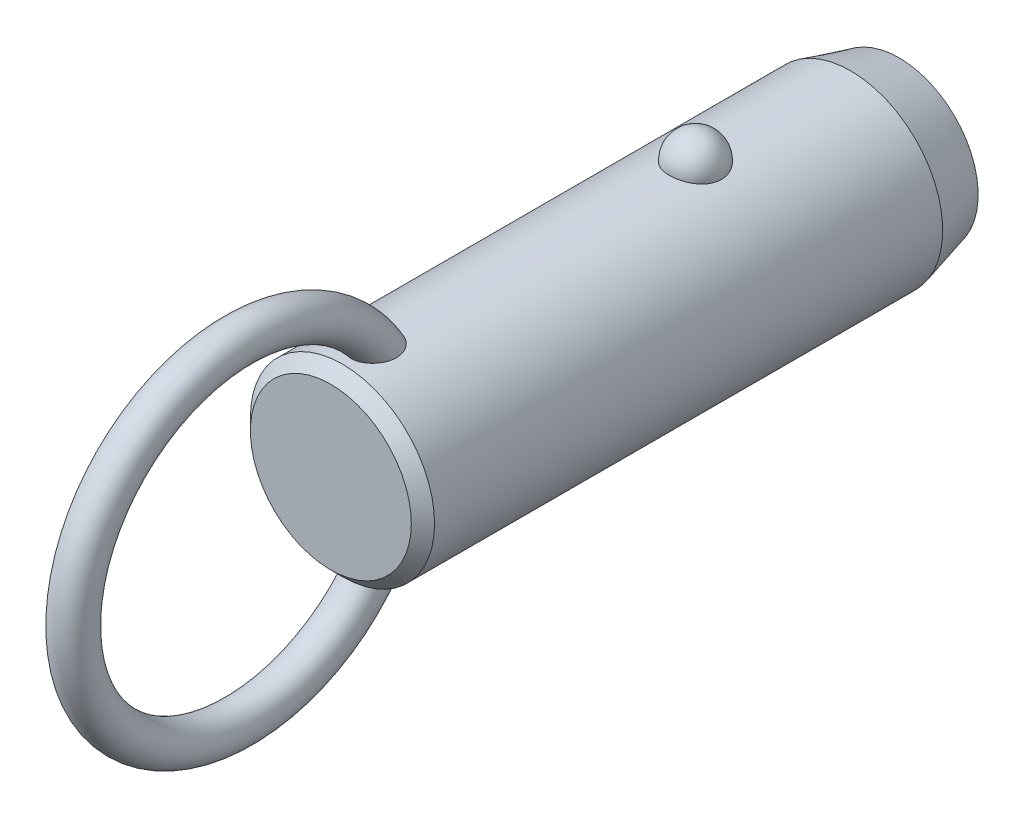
ISO-10303-21;
HEADER;
FILE_DESCRIPTION(('STEP AP214'),'2;1');
FILE_NAME('part.step','',(''),(''),'','','');
FILE_SCHEMA(('AUTOMOTIVE_DESIGN { 1 0 10303 214 1 1 1 1 }'));
ENDSEC;
DATA;
#1=APPLICATION_CONTEXT('core data for automotive mechanical design processes');
#2=APPLICATION_PROTOCOL_DEFINITION('international standard','automotive_design',2000,#1);
#3=PRODUCT_CONTEXT('',#1,'mechanical');
#4=PRODUCT('Part','Part','',(#3));
#5=PRODUCT_RELATED_PRODUCT_CATEGORY('part','',(#4));
#6=PRODUCT_DEFINITION_FORMATION('','',#4);
#7=PRODUCT_DEFINITION_CONTEXT('part definition',#1,'design');
#8=PRODUCT_DEFINITION('design','',#6,#7);
#9=PRODUCT_DEFINITION_SHAPE('','',#8);
#10=(LENGTH_UNIT() NAMED_UNIT(*) SI_UNIT(.MILLI.,.METRE.));
#11=(NAMED_UNIT(*) PLANE_ANGLE_UNIT() SI_UNIT($,.RADIAN.));
#12=(NAMED_UNIT(*) SI_UNIT($,.STERADIAN.) SOLID_ANGLE_UNIT());
#13=UNCERTAINTY_MEASURE_WITH_UNIT(LENGTH_MEASURE(1.E-05),#10,'distance_accuracy_value','');
#14=(GEOMETRIC_REPRESENTATION_CONTEXT(3) GLOBAL_UNCERTAINTY_ASSIGNED_CONTEXT((#13)) GLOBAL_UNIT_ASSIGNED_CONTEXT((#10,
#11,#12)) REPRESENTATION_CONTEXT('',''));
#15=CARTESIAN_POINT('',(0.,0.,0.));
#16=DIRECTION('',(0.,0.,1.));
#17=DIRECTION('',(1.,0.,0.));
#18=AXIS2_PLACEMENT_3D('',#15,#16,#17);
#19=CARTESIAN_POINT('',(0.,0.,25.4));
#20=DIRECTION('',(0.,0.,-1.));
#21=DIRECTION('',(-1.,0.,0.));
#22=AXIS2_PLACEMENT_3D('',#19,#20,#21);
#23=CYLINDRICAL_SURFACE('',#22,9.5);
#24=CARTESIAN_POINT('',(2.67259918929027,9.11631578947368,-2.70000000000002));
#25=CARTESIAN_POINT('',(2.6725968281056,9.11631786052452,-2.54909854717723));
#26=CARTESIAN_POINT('',(2.66030567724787,9.11994722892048,-2.39816735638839));
#27=CARTESIAN_POINT('',(2.6114347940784,9.13405924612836,-2.10058568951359));
#28=CARTESIAN_POINT('',(2.57484658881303,9.14454428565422,-1.95393672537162));
#29=CARTESIAN_POINT('',(2.47830875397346,9.17117631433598,-1.66916069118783));
#30=CARTESIAN_POINT('',(2.41836936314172,9.18732082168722,-1.53102991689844));
#31=CARTESIAN_POINT('',(2.27661331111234,9.22346780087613,-1.26705393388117));
#32=CARTESIAN_POINT('',(2.19479699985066,9.24347021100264,-1.14120852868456));
#33=CARTESIAN_POINT('',(2.01085282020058,9.28522401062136,-0.904632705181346));
#34=CARTESIAN_POINT('',(1.90862396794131,9.30698376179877,-0.793982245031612));
#35=CARTESIAN_POINT('',(1.6867437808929,9.34973971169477,-0.591607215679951));
#36=CARTESIAN_POINT('',(1.56709244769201,9.37073591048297,-0.499882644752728));
#37=CARTESIAN_POINT('',(1.31393976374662,9.40956370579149,-0.338167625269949));
#38=CARTESIAN_POINT('',(1.18048026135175,9.42740444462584,-0.268113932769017));
#39=CARTESIAN_POINT('',(0.903154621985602,9.45799906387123,-0.151390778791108));
#40=CARTESIAN_POINT('',(0.759289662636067,9.47075351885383,-0.104718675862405));
#41=CARTESIAN_POINT('',(0.468074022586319,9.48956256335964,-0.0367633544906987));
#42=CARTESIAN_POINT('',(0.320836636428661,9.49573643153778,-0.015027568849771));
#43=CARTESIAN_POINT('',(0.0246714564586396,9.50112183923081,0.00396199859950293));
#44=CARTESIAN_POINT('',(-0.124256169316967,9.50033406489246,0.00121819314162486));
#45=CARTESIAN_POINT('',(-0.417264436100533,9.4919475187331,-0.0284441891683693));
#46=CARTESIAN_POINT('',(-0.561384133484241,9.48444885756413,-0.0550074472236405));
#47=CARTESIAN_POINT('',(-0.842986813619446,9.46357853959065,-0.131064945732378));
#48=CARTESIAN_POINT('',(-0.98046968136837,9.450206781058,-0.180559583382));
#49=CARTESIAN_POINT('',(-1.24585005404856,9.41890822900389,-0.301476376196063));
#50=CARTESIAN_POINT('',(-1.37368611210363,9.40095498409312,-0.373026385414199));
#51=CARTESIAN_POINT('',(-1.61552738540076,9.3624296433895,-0.536025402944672));
#52=CARTESIAN_POINT('',(-1.72953116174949,9.34185727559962,-0.627476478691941));
#53=CARTESIAN_POINT('',(-1.9429225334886,9.29984568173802,-0.829844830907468));
#54=CARTESIAN_POINT('',(-2.04198021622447,9.27839736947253,-0.941108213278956));
#55=CARTESIAN_POINT('',(-2.2202646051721,9.23735994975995,-1.17883414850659));
#56=CARTESIAN_POINT('',(-2.29948985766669,9.21777097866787,-1.30529781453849));
#57=CARTESIAN_POINT('',(-2.43697287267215,9.18238994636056,-1.57158566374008));
#58=CARTESIAN_POINT('',(-2.49497068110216,9.16664569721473,-1.71155057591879));
#59=CARTESIAN_POINT('',(-2.5872073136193,9.14104303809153,-1.99961197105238));
#60=CARTESIAN_POINT('',(-2.62144683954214,9.13118445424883,-2.1477082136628));
#61=CARTESIAN_POINT('',(-2.66521466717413,9.11850622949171,-2.44715424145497));
#62=CARTESIAN_POINT('',(-2.67484831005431,9.11565658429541,-2.59848735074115));
#63=CARTESIAN_POINT('',(-2.66946735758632,9.11723375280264,-2.90067317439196));
#64=CARTESIAN_POINT('',(-2.65445345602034,9.12166036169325,-3.05152590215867));
#65=CARTESIAN_POINT('',(-2.6002971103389,9.13724422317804,-3.34766110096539));
#66=CARTESIAN_POINT('',(-2.56127978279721,9.14836656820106,-3.49296833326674));
#67=CARTESIAN_POINT('',(-2.46018844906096,9.17606676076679,-3.77477535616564));
#68=CARTESIAN_POINT('',(-2.39811349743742,9.19264483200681,-3.91127478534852));
#69=CARTESIAN_POINT('',(-2.25202303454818,9.22952198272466,-4.17244273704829));
#70=CARTESIAN_POINT('',(-2.16788714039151,9.24984129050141,-4.29704106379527));
#71=CARTESIAN_POINT('',(-1.9799408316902,9.29188255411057,-4.53013066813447));
#72=CARTESIAN_POINT('',(-1.87612963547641,9.31360456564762,-4.63862130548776));
#73=CARTESIAN_POINT('',(-1.65105429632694,9.35612959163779,-4.83690299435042));
#74=CARTESIAN_POINT('',(-1.52972405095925,9.37692871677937,-4.9266199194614));
#75=CARTESIAN_POINT('',(-1.27318250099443,9.41518970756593,-5.08429106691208));
#76=CARTESIAN_POINT('',(-1.13797219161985,9.432651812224,-5.15224684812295));
#77=CARTESIAN_POINT('',(-0.859280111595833,9.46208255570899,-5.26371827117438));
#78=CARTESIAN_POINT('',(-0.715925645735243,9.47411833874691,-5.30753421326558));
#79=CARTESIAN_POINT('',(-0.423550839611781,9.4916822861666,-5.37076321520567));
#80=CARTESIAN_POINT('',(-0.274531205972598,9.49721125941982,-5.39017930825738));
#81=CARTESIAN_POINT('',(0.0218446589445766,9.50110860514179,-5.40390587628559));
#82=CARTESIAN_POINT('',(0.169177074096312,9.49961381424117,-5.39869609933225));
#83=CARTESIAN_POINT('',(0.460808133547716,9.48993906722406,-5.36441955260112));
#84=CARTESIAN_POINT('',(0.605106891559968,9.48175936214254,-5.33535367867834));
#85=CARTESIAN_POINT('',(0.886027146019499,9.4596376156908,-5.25435587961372));
#86=CARTESIAN_POINT('',(1.02267710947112,9.44571881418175,-5.20251612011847));
#87=CARTESIAN_POINT('',(1.28523827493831,9.41358993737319,-5.07741549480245));
#88=CARTESIAN_POINT('',(1.41114877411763,9.39537958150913,-5.00415322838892));
#89=CARTESIAN_POINT('',(1.65085227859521,9.3562644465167,-4.83684599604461));
#90=CARTESIAN_POINT('',(1.76442346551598,9.33532178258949,-4.74249218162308));
#91=CARTESIAN_POINT('',(1.97425672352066,9.29321198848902,-4.53620389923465));
#92=CARTESIAN_POINT('',(2.07051582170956,9.27204482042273,-4.42426641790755));
#93=CARTESIAN_POINT('',(2.24490086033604,9.23139221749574,-4.18363183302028));
#94=CARTESIAN_POINT('',(2.32267019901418,9.21194380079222,-4.05466990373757));
#95=CARTESIAN_POINT('',(2.45584092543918,9.1773419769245,-3.78517836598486));
#96=CARTESIAN_POINT('',(2.51124979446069,9.16218713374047,-3.644652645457));
#97=CARTESIAN_POINT('',(2.59380876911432,9.13913522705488,-3.37104301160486));
#98=CARTESIAN_POINT('',(2.62330266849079,9.13064624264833,-3.23871053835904));
#99=CARTESIAN_POINT('',(2.66269870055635,9.11923566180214,-2.97092664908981));
#100=CARTESIAN_POINT('',(2.67260130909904,9.11631393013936,-2.83547530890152));
#101=CARTESIAN_POINT('',(2.67259918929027,9.11631578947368,-2.70000000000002));
#102=B_SPLINE_CURVE_WITH_KNOTS('',3,(#24,#25,#26,#27,#28,#29,#30,#31,#32,#33,#34,#35,#36,#37,
#38,#39,#40,#41,#42,#43,#44,#45,#46,#47,#48,#49,#50,#51,#52,#53,#54,#55,#56,#57,#58,#59,#60,#61,
#62,#63,#64,#65,#66,#67,#68,#69,#70,#71,#72,#73,#74,#75,#76,#77,#78,#79,#80,#81,#82,#83,#84,#85,
#86,#87,#88,#89,#90,#91,#92,#93,#94,#95,#96,#97,#98,#99,#100,#101),.UNSPECIFIED.,.T.,.F.,(4,2,2,
2,2,2,2,2,2,2,2,2,2,2,2,2,2,2,2,2,2,2,2,2,2,2,2,2,2,2,2,2,2,2,2,2,2,2,4),(0.,0.452217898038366,
0.904593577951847,1.35677112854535,1.80894144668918,2.26340676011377,2.71787203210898,
3.17099820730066,3.62407318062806,4.0687883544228,4.51345969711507,4.95160616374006,
5.38976021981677,5.83050358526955,6.27129275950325,6.72071308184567,7.17016633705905,
7.62495278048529,8.07972578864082,8.53254856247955,8.98535859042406,9.43582813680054,
9.88631615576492,10.3393155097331,10.7923328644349,11.2471065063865,11.7018475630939,
12.1507959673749,12.5996885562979,13.0398725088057,13.4800399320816,13.9184421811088,
14.3568730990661,14.802202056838,15.2476074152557,15.7010097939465,16.1542603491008,
16.5602594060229,16.9662486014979),.UNSPECIFIED.);
#103=CARTESIAN_POINT('',(2.67259918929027,9.11631578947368,-2.70000000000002));
#104=VERTEX_POINT('',#103);
#105=EDGE_CURVE('E41',#104,#104,#102,.T.);
#106=ORIENTED_EDGE('',*,*,#105,.T.);
#107=EDGE_LOOP('',(#106));
#108=FACE_BOUND('',#107,.T.);
#109=CARTESIAN_POINT('',(0.,0.,33.72));
#110=DIRECTION('',(0.,0.,1.));
#111=DIRECTION('',(1.,0.,0.));
#112=AXIS2_PLACEMENT_3D('',#109,#110,#111);
#113=CIRCLE('',#112,9.5);
#114=CARTESIAN_POINT('',(9.5,0.,33.72));
#115=VERTEX_POINT('',#114);
#116=EDGE_CURVE('E10',#115,#115,#113,.F.);
#117=ORIENTED_EDGE('',*,*,#116,.T.);
#118=EDGE_LOOP('',(#117));
#119=FACE_BOUND('',#118,.T.);
#120=CARTESIAN_POINT('',(-0.697062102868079,-9.47439269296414,28.0678088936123));
#121=CARTESIAN_POINT('',(-0.799579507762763,-9.46685146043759,28.1074823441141));
#122=CARTESIAN_POINT('',(-0.898575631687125,-9.45788043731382,28.1559309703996));
#123=CARTESIAN_POINT('',(-1.08670047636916,-9.43811593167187,28.2688685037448));
#124=CARTESIAN_POINT('',(-1.17583204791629,-9.42732297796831,28.3333527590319));
#125=CARTESIAN_POINT('',(-1.34179806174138,-9.40513672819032,28.4762099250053));
#126=CARTESIAN_POINT('',(-1.41865133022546,-9.39374438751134,28.554561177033));
#127=CARTESIAN_POINT('',(-1.5586004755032,-9.37154196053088,28.7227524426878));
#128=CARTESIAN_POINT('',(-1.62169476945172,-9.3607319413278,28.8125937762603));
#129=CARTESIAN_POINT('',(-1.73527695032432,-9.34035749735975,29.0045001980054));
#130=CARTESIAN_POINT('',(-1.7852226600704,-9.33085270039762,29.1068910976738));
#131=CARTESIAN_POINT('',(-1.86924997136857,-9.3143834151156,29.318148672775));
#132=CARTESIAN_POINT('',(-1.90332570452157,-9.30741986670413,29.4270177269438));
#133=CARTESIAN_POINT('',(-1.95893603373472,-9.29588482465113,29.6604730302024));
#134=CARTESIAN_POINT('',(-1.97872420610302,-9.29165182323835,29.7854890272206));
#135=CARTESIAN_POINT('',(-2.00062129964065,-9.28695978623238,30.0370805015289));
#136=CARTESIAN_POINT('',(-2.00272284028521,-9.28650232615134,30.163656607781));
#137=CARTESIAN_POINT('',(-1.98958876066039,-9.28932750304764,30.4368157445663));
#138=CARTESIAN_POINT('',(-1.97143366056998,-9.2932400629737,30.5832519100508));
#139=CARTESIAN_POINT('',(-1.91479925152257,-9.30507151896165,30.8720629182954));
#140=CARTESIAN_POINT('',(-1.87629122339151,-9.31299607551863,31.014431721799));
#141=CARTESIAN_POINT('',(-1.7722568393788,-9.33340232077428,31.3151725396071));
#142=CARTESIAN_POINT('',(-1.70334898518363,-9.34641636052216,31.4723691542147));
#143=CARTESIAN_POINT('',(-1.58111062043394,-9.36759153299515,31.6975171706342));
#144=CARTESIAN_POINT('',(-1.53721459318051,-9.37492619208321,31.7707968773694));
#145=CARTESIAN_POINT('',(-1.4430263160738,-9.38988566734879,31.9130740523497));
#146=CARTESIAN_POINT('',(-1.39273721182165,-9.39751033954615,31.9820736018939));
#147=CARTESIAN_POINT('',(-1.26775962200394,-9.41530678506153,32.1369832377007));
#148=CARTESIAN_POINT('',(-1.19052326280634,-9.42548108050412,32.2208712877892));
#149=CARTESIAN_POINT('',(-1.0242024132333,-9.44499825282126,32.3760086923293));
#150=CARTESIAN_POINT('',(-0.935139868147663,-9.45434261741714,32.4472808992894));
#151=CARTESIAN_POINT('',(-0.76661041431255,-9.46930670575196,32.5586955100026));
#152=CARTESIAN_POINT('',(-0.689439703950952,-9.47529223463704,32.6022354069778));
#153=CARTESIAN_POINT('',(-0.528942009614,-9.48560294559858,32.6763133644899));
#154=CARTESIAN_POINT('',(-0.445620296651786,-9.48992953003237,32.7068624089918));
#155=CARTESIAN_POINT('',(-0.273901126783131,-9.49644161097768,32.7525792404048));
#156=CARTESIAN_POINT('',(-0.185465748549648,-9.49860811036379,32.76761059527));
#157=CARTESIAN_POINT('',(-0.00734541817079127,-9.5004135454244,32.7801494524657));
#158=CARTESIAN_POINT('',(0.0823387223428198,-9.50005405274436,32.7776678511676));
#159=CARTESIAN_POINT('',(0.247679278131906,-9.49708301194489,32.7569959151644));
#160=CARTESIAN_POINT('',(0.323620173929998,-9.49477609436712,32.7409300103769));
#161=CARTESIAN_POINT('',(0.471981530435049,-9.48855917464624,32.6971726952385));
#162=CARTESIAN_POINT('',(0.544400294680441,-9.48464840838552,32.669475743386));
#163=CARTESIAN_POINT('',(0.708947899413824,-9.47398336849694,32.5928026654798));
#164=CARTESIAN_POINT('',(0.799149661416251,-9.46671310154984,32.5397745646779));
#165=CARTESIAN_POINT('',(0.969783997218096,-9.4507622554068,32.4199731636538));
#166=CARTESIAN_POINT('',(1.05019415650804,-9.44207854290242,32.3531692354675));
#167=CARTESIAN_POINT('',(1.23092343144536,-9.42051459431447,32.1807596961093));
#168=CARTESIAN_POINT('',(1.32652499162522,-9.40733378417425,32.0702619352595));
#169=CARTESIAN_POINT('',(1.49893121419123,-9.38140745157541,31.8355614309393));
#170=CARTESIAN_POINT('',(1.57571616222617,-9.36866239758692,31.7113445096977));
#171=CARTESIAN_POINT('',(1.71285426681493,-9.34457644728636,31.4493891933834));
#172=CARTESIAN_POINT('',(1.77266365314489,-9.33328726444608,31.3113623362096));
#173=CARTESIAN_POINT('',(1.87239208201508,-9.31379209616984,31.0280515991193));
#174=CARTESIAN_POINT('',(1.91230158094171,-9.3055875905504,30.882764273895));
#175=CARTESIAN_POINT('',(1.9760418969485,-9.29228394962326,30.5620281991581));
#176=CARTESIAN_POINT('',(1.99587438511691,-9.28797202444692,30.3857248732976));
#177=CARTESIAN_POINT('',(2.0029570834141,-9.28645519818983,30.0324146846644));
#178=CARTESIAN_POINT('',(1.99025930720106,-9.28923895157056,29.8554093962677));
#179=CARTESIAN_POINT('',(1.93735479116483,-9.30038134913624,29.5563381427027));
#180=CARTESIAN_POINT('',(1.90576827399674,-9.30697680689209,29.4326679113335));
#181=CARTESIAN_POINT('',(1.82287484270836,-9.32356855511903,29.1923297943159));
#182=CARTESIAN_POINT('',(1.7715821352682,-9.33356239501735,29.0756569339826));
#183=CARTESIAN_POINT('',(1.64885744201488,-9.35602275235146,28.8527061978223));
#184=CARTESIAN_POINT('',(1.57730995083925,-9.36850332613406,28.7464927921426));
#185=CARTESIAN_POINT('',(1.41543264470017,-9.39431873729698,28.5495530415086));
#186=CARTESIAN_POINT('',(1.3251088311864,-9.40765330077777,28.4588217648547));
#187=CARTESIAN_POINT('',(1.13846223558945,-9.43195720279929,28.3050334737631));
#188=CARTESIAN_POINT('',(1.04369890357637,-9.44302894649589,28.2400947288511));
#189=CARTESIAN_POINT('',(0.843965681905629,-9.46296805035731,28.1280388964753));
#190=CARTESIAN_POINT('',(0.739000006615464,-9.4718363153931,28.0809144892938));
#191=CARTESIAN_POINT('',(0.52817529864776,-9.48586140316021,28.0081173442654));
#192=CARTESIAN_POINT('',(0.422686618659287,-9.49119633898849,27.9814024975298));
#193=CARTESIAN_POINT('',(0.208590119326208,-9.49831365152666,27.9460137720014));
#194=CARTESIAN_POINT('',(0.0999817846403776,-9.500095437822,27.9373428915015));
#195=CARTESIAN_POINT('',(-0.126104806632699,-9.49988861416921,27.9383501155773));
#196=CARTESIAN_POINT('',(-0.243578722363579,-9.49757821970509,27.9495942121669));
#197=CARTESIAN_POINT('',(-0.474390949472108,-9.48885165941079,27.993167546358));
#198=CARTESIAN_POINT('',(-0.587729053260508,-9.48243528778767,28.0254978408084));
#199=CARTESIAN_POINT('',(-0.697062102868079,-9.47439269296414,28.0678088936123));
#200=B_SPLINE_CURVE_WITH_KNOTS('',3,(#120,#121,#122,#123,#124,#125,#126,#127,#128,#129,#130,
#131,#132,#133,#134,#135,#136,#137,#138,#139,#140,#141,#142,#143,#144,#145,#146,#147,#148,#149,
#150,#151,#152,#153,#154,#155,#156,#157,#158,#159,#160,#161,#162,#163,#164,#165,#166,#167,#168,
#169,#170,#171,#172,#173,#174,#175,#176,#177,#178,#179,#180,#181,#182,#183,#184,#185,#186,#187,
#188,#189,#190,#191,#192,#193,#194,#195,#196,#197,#198,#199),.UNSPECIFIED.,.T.,.F.,(4,2,2,2,2,2,
2,2,2,2,2,2,2,2,2,2,2,2,2,2,2,2,2,2,2,2,2,2,2,2,2,2,2,2,2,2,2,2,2,4),(0.,0.330119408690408,
0.660143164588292,0.989655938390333,1.31920659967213,1.66074728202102,2.00241415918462,
2.38088696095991,2.75951768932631,3.20065679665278,3.64242004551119,4.15620996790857,
4.41314162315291,4.66994734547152,5.01228664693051,5.35399933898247,5.61943037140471,
5.88463652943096,6.15215502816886,6.41950709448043,6.65144391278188,6.88349136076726,
7.19641200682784,7.51003602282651,7.94779711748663,8.38601491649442,8.83699707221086,
9.2881953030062,9.81778662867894,10.3465317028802,10.7284172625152,11.110028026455,
11.4938603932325,11.8775702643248,12.2220189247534,12.5663259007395,12.8915939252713,
13.2169159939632,13.5689650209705,13.9210316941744),.UNSPECIFIED.);
#201=CARTESIAN_POINT('',(-0.697062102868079,-9.47439269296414,28.0678088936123));
#202=VERTEX_POINT('',#201);
#203=EDGE_CURVE('E58',#202,#202,#200,.T.);
#204=ORIENTED_EDGE('',*,*,#203,.T.);
#205=EDGE_LOOP('',(#204));
#206=FACE_BOUND('',#205,.T.);
#207=CARTESIAN_POINT('',(-0.697062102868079,9.47439269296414,28.0678088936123));
#208=CARTESIAN_POINT('',(-0.597792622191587,9.48169483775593,28.0293956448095));
#209=CARTESIAN_POINT('',(-0.495106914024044,9.48766580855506,27.9991682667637));
#210=CARTESIAN_POINT('',(-0.285876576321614,9.49627648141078,27.9560327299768));
#211=CARTESIAN_POINT('',(-0.179324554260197,9.49890941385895,27.9431597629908));
#212=CARTESIAN_POINT('',(0.0344157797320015,9.50053798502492,27.9351666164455));
#213=CARTESIAN_POINT('',(0.141603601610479,9.49953613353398,27.9400341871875));
#214=CARTESIAN_POINT('',(0.353563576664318,9.49401038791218,27.9673654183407));
#215=CARTESIAN_POINT('',(0.458336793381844,9.48948807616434,27.98982117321));
#216=CARTESIAN_POINT('',(0.662493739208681,9.4774236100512,28.0516719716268));
#217=CARTESIAN_POINT('',(0.76188104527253,9.46988348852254,28.0910556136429));
#218=CARTESIAN_POINT('',(0.952608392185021,9.45260382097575,28.1856342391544));
#219=CARTESIAN_POINT('',(1.04394806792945,9.44286417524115,28.2408299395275));
#220=CARTESIAN_POINT('',(1.21712767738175,9.4221176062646,28.3660662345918));
#221=CARTESIAN_POINT('',(1.29885671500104,9.41109835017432,28.4362579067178));
#222=CARTESIAN_POINT('',(1.44978975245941,9.38903310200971,28.588980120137));
#223=CARTESIAN_POINT('',(1.51899278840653,9.37798710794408,28.6715116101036));
#224=CARTESIAN_POINT('',(1.64602857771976,9.35654375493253,28.8497763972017));
#225=CARTESIAN_POINT('',(1.70333052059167,9.34618688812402,28.9458916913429));
#226=CARTESIAN_POINT('',(1.80259341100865,9.32755128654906,29.145897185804));
#227=CARTESIAN_POINT('',(1.84454942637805,9.31927322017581,29.2497898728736));
#228=CARTESIAN_POINT('',(1.91637039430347,9.30478365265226,29.472213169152));
#229=CARTESIAN_POINT('',(1.944805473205,9.29882552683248,29.5912192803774));
#230=CARTESIAN_POINT('',(1.98449865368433,9.29043398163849,29.8321436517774));
#231=CARTESIAN_POINT('',(1.99574908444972,9.28800213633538,29.9540631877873));
#232=CARTESIAN_POINT('',(2.00275141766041,9.28649645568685,30.2169324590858));
#233=CARTESIAN_POINT('',(1.99588238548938,9.28799035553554,30.3579529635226));
#234=CARTESIAN_POINT('',(1.96270559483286,9.29505517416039,30.6376217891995));
#235=CARTESIAN_POINT('',(1.93637872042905,9.30063010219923,30.776267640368));
#236=CARTESIAN_POINT('',(1.85949176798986,9.31633564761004,31.0725616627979));
#237=CARTESIAN_POINT('',(1.80549792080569,9.3270926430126,31.2292907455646));
#238=CARTESIAN_POINT('',(1.67376869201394,9.3516306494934,31.5322840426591));
#239=CARTESIAN_POINT('',(1.59603181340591,9.36541185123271,31.6785475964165));
#240=CARTESIAN_POINT('',(1.4360277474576,9.39110706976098,31.9258138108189));
#241=CARTESIAN_POINT('',(1.35831795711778,9.40278656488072,32.029791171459));
#242=CARTESIAN_POINT('',(1.18774483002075,9.42585025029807,32.2245347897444));
#243=CARTESIAN_POINT('',(1.09490932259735,9.43723493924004,32.3153247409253));
#244=CARTESIAN_POINT('',(0.921110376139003,9.45552616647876,32.4562033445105));
#245=CARTESIAN_POINT('',(0.843738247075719,9.46281058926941,32.5106563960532));
#246=CARTESIAN_POINT('',(0.681245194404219,9.47589120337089,32.606711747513));
#247=CARTESIAN_POINT('',(0.596135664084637,9.48168953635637,32.6483325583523));
#248=CARTESIAN_POINT('',(0.433779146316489,9.49038144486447,32.7100899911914));
#249=CARTESIAN_POINT('',(0.357459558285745,9.49359170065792,32.7326013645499));
#250=CARTESIAN_POINT('',(0.202074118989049,9.49816761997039,32.7645745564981));
#251=CARTESIAN_POINT('',(0.123010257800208,9.49953459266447,32.7740456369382));
#252=CARTESIAN_POINT('',(-0.0357372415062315,9.50026497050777,32.7791143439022));
#253=CARTESIAN_POINT('',(-0.115421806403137,9.49962433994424,32.7746840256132));
#254=CARTESIAN_POINT('',(-0.272823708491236,9.49640854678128,32.7522962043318));
#255=CARTESIAN_POINT('',(-0.350540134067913,9.4938325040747,32.7343325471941));
#256=CARTESIAN_POINT('',(-0.500580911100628,9.4870946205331,32.6868028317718));
#257=CARTESIAN_POINT('',(-0.572979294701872,9.48296359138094,32.6574618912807));
#258=CARTESIAN_POINT('',(-0.712864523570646,9.47347609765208,32.5890087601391));
#259=CARTESIAN_POINT('',(-0.780349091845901,9.46811906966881,32.5498920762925));
#260=CARTESIAN_POINT('',(-0.946309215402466,9.45329720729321,32.439432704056));
#261=CARTESIAN_POINT('',(-1.04090230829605,9.44321512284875,32.3623297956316));
#262=CARTESIAN_POINT('',(-1.21661929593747,9.42219227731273,32.1940971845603));
#263=CARTESIAN_POINT('',(-1.29770519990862,9.41124921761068,32.1029292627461));
#264=CARTESIAN_POINT('',(-1.4731964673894,9.38563439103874,31.8761621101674));
#265=CARTESIAN_POINT('',(-1.56208878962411,9.37102009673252,31.7362895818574));
#266=CARTESIAN_POINT('',(-1.71623987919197,9.34401559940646,31.4439503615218));
#267=CARTESIAN_POINT('',(-1.78147866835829,9.33162728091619,31.2914731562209));
#268=CARTESIAN_POINT('',(-1.88853837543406,9.31055541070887,30.9756470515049));
#269=CARTESIAN_POINT('',(-1.9299899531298,9.30193076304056,30.8121685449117));
#270=CARTESIAN_POINT('',(-1.98590726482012,9.29015757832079,30.4805268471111));
#271=CARTESIAN_POINT('',(-2.00040705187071,9.2870021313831,30.3123698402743));
#272=CARTESIAN_POINT('',(-1.99964701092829,9.28716218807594,30.0050806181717));
#273=CARTESIAN_POINT('',(-1.98908145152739,9.28945704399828,29.8659362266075));
#274=CARTESIAN_POINT('',(-1.94566294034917,9.29865169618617,29.5911539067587));
#275=CARTESIAN_POINT('',(-1.91282062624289,9.30554929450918,29.455514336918));
#276=CARTESIAN_POINT('',(-1.84582133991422,9.31898248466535,29.2578026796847));
#277=CARTESIAN_POINT('',(-1.8203808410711,9.32400364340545,29.192583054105));
#278=CARTESIAN_POINT('',(-1.7635051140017,9.33492884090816,29.0649033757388));
#279=CARTESIAN_POINT('',(-1.73207305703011,9.34083241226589,29.0024418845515));
#280=CARTESIAN_POINT('',(-1.66324243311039,9.353333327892,28.8809407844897));
#281=CARTESIAN_POINT('',(-1.62584239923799,9.35993084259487,28.8219020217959));
#282=CARTESIAN_POINT('',(-1.54527678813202,9.37356864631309,28.7079875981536));
#283=CARTESIAN_POINT('',(-1.50211241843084,9.38060884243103,28.6531110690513));
#284=CARTESIAN_POINT('',(-1.37681147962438,9.40004442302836,28.5099619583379));
#285=CARTESIAN_POINT('',(-1.28916358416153,9.41261047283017,28.4264295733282));
#286=CARTESIAN_POINT('',(-1.09996826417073,9.43658180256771,28.2772360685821));
#287=CARTESIAN_POINT('',(-0.998461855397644,9.44799034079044,28.2115238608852));
#288=CARTESIAN_POINT('',(-0.860188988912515,9.46103017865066,28.1394367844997));
#289=CARTESIAN_POINT('',(-0.828141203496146,9.46389141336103,28.1238511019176));
#290=CARTESIAN_POINT('',(-0.763210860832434,9.46934915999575,28.0944734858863));
#291=CARTESIAN_POINT('',(-0.730328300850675,9.47194567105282,28.0806815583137));
#292=CARTESIAN_POINT('',(-0.697062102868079,9.47439269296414,28.0678088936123));
#293=B_SPLINE_CURVE_WITH_KNOTS('',3,(#207,#208,#209,#210,#211,#212,#213,#214,#215,#216,#217,
#218,#219,#220,#221,#222,#223,#224,#225,#226,#227,#228,#229,#230,#231,#232,#233,#234,#235,#236,
#237,#238,#239,#240,#241,#242,#243,#244,#245,#246,#247,#248,#249,#250,#251,#252,#253,#254,#255,
#256,#257,#258,#259,#260,#261,#262,#263,#264,#265,#266,#267,#268,#269,#270,#271,#272,#273,#274,
#275,#276,#277,#278,#279,#280,#281,#282,#283,#284,#285,#286,#287,#288,#289,#290,#291,#292),
.UNSPECIFIED.,.T.,.F.,(4,2,2,2,2,2,2,2,2,2,2,2,2,2,2,2,2,2,2,2,2,2,2,2,2,2,2,2,2,2,2,2,2,2,2,2,
2,2,2,2,2,2,4),(0.,0.319942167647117,0.640532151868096,0.960900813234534,1.28112555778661,
1.60113495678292,1.92115886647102,2.24457323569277,2.56801248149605,2.90371927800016,
3.23953387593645,3.60560313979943,3.97183576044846,4.39383693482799,4.81625324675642,
5.31257045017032,5.80891895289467,6.19868344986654,6.58773876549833,6.87145417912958,
7.15475838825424,7.39263751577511,7.63034760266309,7.8685358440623,8.10683246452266,
8.34063661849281,8.57454843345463,8.93983939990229,9.30614105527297,9.80266668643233,
10.2996107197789,10.8040753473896,11.3079021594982,11.7249776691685,12.1418541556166,
12.3521485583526,12.562331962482,12.7725671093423,12.9827582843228,13.3458276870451,
13.7078449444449,13.8150604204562,13.9222762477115),.UNSPECIFIED.);
#294=CARTESIAN_POINT('',(-0.697062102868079,9.47439269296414,28.0678088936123));
#295=VERTEX_POINT('',#294);
#296=EDGE_CURVE('E66',#295,#295,#293,.T.);
#297=ORIENTED_EDGE('',*,*,#296,.T.);
#298=EDGE_LOOP('',(#297));
#299=FACE_BOUND('',#298,.T.);
#300=CARTESIAN_POINT('',(0.,0.,-18.6999999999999));
#301=DIRECTION('',(0.,0.,-1.));
#302=DIRECTION('',(-1.,0.,0.));
#303=AXIS2_PLACEMENT_3D('',#300,#301,#302);
#304=CIRCLE('',#303,9.5);
#305=CARTESIAN_POINT('',(-9.5,0.,-18.6999999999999));
#306=VERTEX_POINT('',#305);
#307=EDGE_CURVE('E55',#306,#306,#304,.F.);
#308=ORIENTED_EDGE('',*,*,#307,.T.);
#309=EDGE_LOOP('',(#308));
#310=FACE_BOUND('',#309,.T.);
#311=ADVANCED_FACE('F37',(#108,#119,#206,#299,#310),#23,.T.);
#312=CARTESIAN_POINT('',(0.,0.,-23.7));
#313=DIRECTION('',(0.,0.,-1.));
#314=DIRECTION('',(-1.,0.,0.));
#315=AXIS2_PLACEMENT_3D('',#312,#313,#314);
#316=PLANE('',#315);
#317=CARTESIAN_POINT('',(0.,0.,-23.7));
#318=DIRECTION('',(0.,0.,-1.));
#319=DIRECTION('',(-1.,0.,0.));
#320=AXIS2_PLACEMENT_3D('',#317,#318,#319);
#321=CIRCLE('',#320,8.16025403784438);
#322=CARTESIAN_POINT('',(-8.16025403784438,0.,-23.7));
#323=VERTEX_POINT('',#322);
#324=EDGE_CURVE('E65',#323,#323,#321,.T.);
#325=ORIENTED_EDGE('',*,*,#324,.T.);
#326=EDGE_LOOP('',(#325));
#327=FACE_BOUND('',#326,.T.);
#328=ADVANCED_FACE('F84',(#327),#316,.T.);
#329=CARTESIAN_POINT('',(0.,0.,-23.7));
#330=DIRECTION('',(0.,0.,1.));
#331=DIRECTION('',(1.,0.,0.));
#332=AXIS2_PLACEMENT_3D('',#329,#330,#331);
#333=CONICAL_SURFACE('',#332,8.16025403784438,0.261799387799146);
#334=ORIENTED_EDGE('',*,*,#307,.F.);
#335=EDGE_LOOP('',(#334));
#336=FACE_BOUND('',#335,.T.);
#337=ORIENTED_EDGE('',*,*,#324,.F.);
#338=EDGE_LOOP('',(#337));
#339=FACE_BOUND('',#338,.T.);
#340=ADVANCED_FACE('F82',(#336,#339),#333,.T.);
#341=CARTESIAN_POINT('',(0.,0.,34.92));
#342=DIRECTION('',(0.,0.,1.));
#343=DIRECTION('',(1.,0.,0.));
#344=AXIS2_PLACEMENT_3D('',#341,#342,#343);
#345=PLANE('',#344);
#346=CARTESIAN_POINT('',(0.,0.,34.92));
#347=DIRECTION('',(0.,0.,1.));
#348=DIRECTION('',(1.,0.,0.));
#349=AXIS2_PLACEMENT_3D('',#346,#347,#348);
#350=CIRCLE('',#349,8.30000000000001);
#351=CARTESIAN_POINT('',(8.30000000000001,0.,34.92));
#352=VERTEX_POINT('',#351);
#353=EDGE_CURVE('E50',#352,#352,#350,.T.);
#354=ORIENTED_EDGE('',*,*,#353,.T.);
#355=EDGE_LOOP('',(#354));
#356=FACE_BOUND('',#355,.T.);
#357=ADVANCED_FACE('F76',(#356),#345,.T.);
#358=CARTESIAN_POINT('',(0.,0.,44.45));
#359=DIRECTION('',(1.,0.,0.));
#360=DIRECTION('',(0.,0.,-1.));
#361=AXIS2_PLACEMENT_3D('',#358,#359,#360);
#362=TOROIDAL_SURFACE('',#361,17.05,2.);
#363=ORIENTED_EDGE('',*,*,#296,.F.);
#364=EDGE_LOOP('',(#363));
#365=FACE_BOUND('',#364,.T.);
#366=ORIENTED_EDGE('',*,*,#203,.F.);
#367=EDGE_LOOP('',(#366));
#368=FACE_BOUND('',#367,.T.);
#369=ADVANCED_FACE('F72',(#365,#368),#362,.T.);
#370=CARTESIAN_POINT('',(0.,0.,34.92));
#371=DIRECTION('',(0.,0.,-1.));
#372=DIRECTION('',(-1.,0.,0.));
#373=AXIS2_PLACEMENT_3D('',#370,#371,#372);
#374=CONICAL_SURFACE('',#373,8.30000000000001,0.78539816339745);
#375=ORIENTED_EDGE('',*,*,#116,.F.);
#376=EDGE_LOOP('',(#375));
#377=FACE_BOUND('',#376,.T.);
#378=ORIENTED_EDGE('',*,*,#353,.F.);
#379=EDGE_LOOP('',(#378));
#380=FACE_BOUND('',#379,.T.);
#381=ADVANCED_FACE('F39',(#377,#380),#374,.T.);
#382=CARTESIAN_POINT('',(0.,9.5,-2.70000000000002));
#383=DIRECTION('',(0.,1.,0.));
#384=DIRECTION('',(0.,0.,1.));
#385=AXIS2_PLACEMENT_3D('',#382,#383,#384);
#386=SPHERICAL_SURFACE('',#385,2.7);
#387=ORIENTED_EDGE('',*,*,#105,.F.);
#388=EDGE_LOOP('',(#387));
#389=FACE_BOUND('',#388,.T.);
#390=ADVANCED_FACE('F78',(#389),#386,.T.);
#391=CLOSED_SHELL('',(#311,#328,#340,#357,#369,#381,#390));
#392=MANIFOLD_SOLID_BREP('B2',#391);
#393=ADVANCED_BREP_SHAPE_REPRESENTATION('',(#18,#392),#14);
#394=SHAPE_DEFINITION_REPRESENTATION(#9,#393);
ENDSEC;
END-ISO-10303-21;
